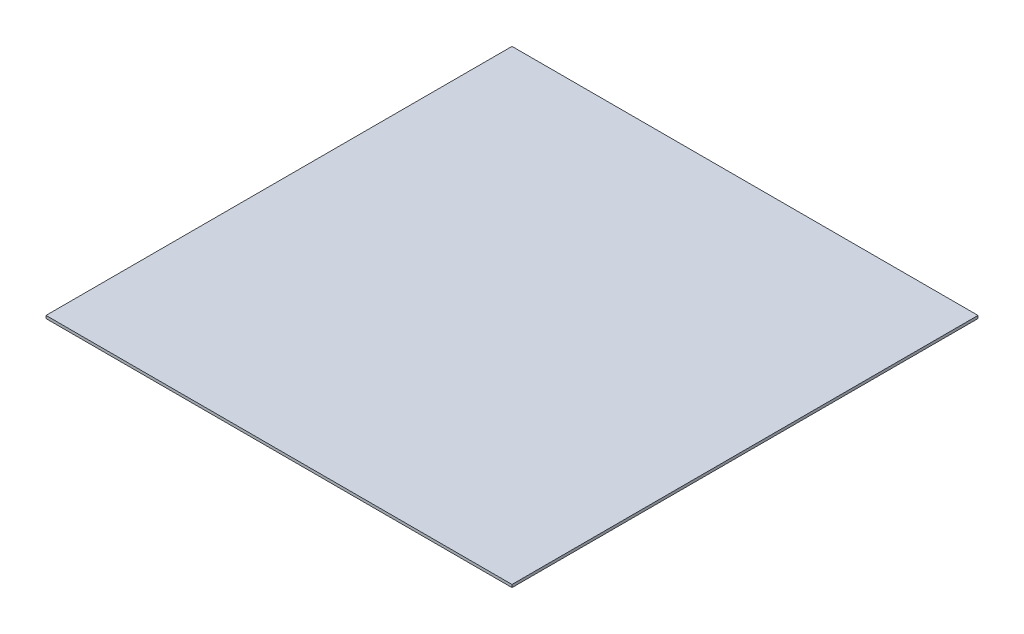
from build123d import *

# Parameters (mm, degrees)
SKETCH1_W           = 1066.8
SKETCH1_H           = 1066.8
BOSS_EXTRUDE1_DEPTH = 6.35


with BuildPart() as part:
    # Sketch1 → Boss-Extrude1 (new body)
    with BuildSketch(Plane(origin=(0, 0, 0), x_dir=(1, 0, 0), z_dir=(0, 1, 0))):
        Rectangle(SKETCH1_W, SKETCH1_H)
    extrude(amount=BOSS_EXTRUDE1_DEPTH)


solid = part.part
